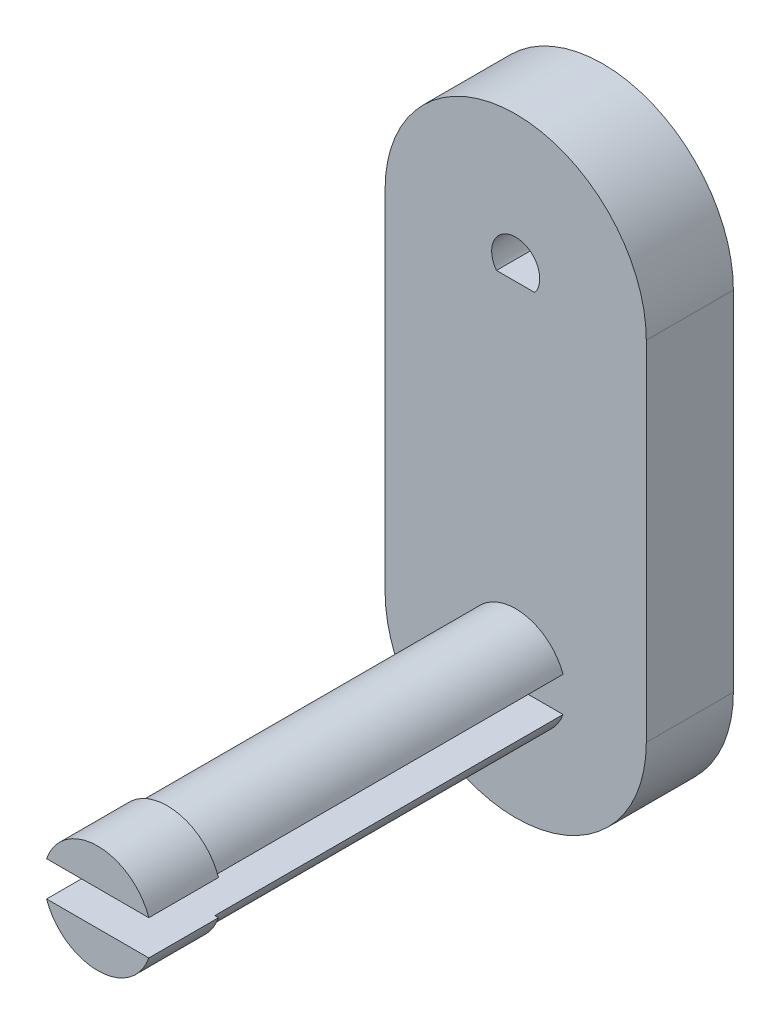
ISO-10303-21;
HEADER;
FILE_DESCRIPTION(('STEP AP214'),'2;1');
FILE_NAME('part.step','',(''),(''),'','','');
FILE_SCHEMA(('AUTOMOTIVE_DESIGN { 1 0 10303 214 1 1 1 1 }'));
ENDSEC;
DATA;
#1=APPLICATION_CONTEXT('core data for automotive mechanical design processes');
#2=APPLICATION_PROTOCOL_DEFINITION('international standard','automotive_design',2000,#1);
#3=PRODUCT_CONTEXT('',#1,'mechanical');
#4=PRODUCT('Part','Part','',(#3));
#5=PRODUCT_RELATED_PRODUCT_CATEGORY('part','',(#4));
#6=PRODUCT_DEFINITION_FORMATION('','',#4);
#7=PRODUCT_DEFINITION_CONTEXT('part definition',#1,'design');
#8=PRODUCT_DEFINITION('design','',#6,#7);
#9=PRODUCT_DEFINITION_SHAPE('','',#8);
#10=(LENGTH_UNIT() NAMED_UNIT(*) SI_UNIT(.MILLI.,.METRE.));
#11=(NAMED_UNIT(*) PLANE_ANGLE_UNIT() SI_UNIT($,.RADIAN.));
#12=(NAMED_UNIT(*) SI_UNIT($,.STERADIAN.) SOLID_ANGLE_UNIT());
#13=UNCERTAINTY_MEASURE_WITH_UNIT(LENGTH_MEASURE(1.E-05),#10,'distance_accuracy_value','');
#14=(GEOMETRIC_REPRESENTATION_CONTEXT(3) GLOBAL_UNCERTAINTY_ASSIGNED_CONTEXT((#13)) GLOBAL_UNIT_ASSIGNED_CONTEXT((#10,
#11,#12)) REPRESENTATION_CONTEXT('',''));
#15=CARTESIAN_POINT('',(0.,0.,0.));
#16=DIRECTION('',(0.,0.,1.));
#17=DIRECTION('',(1.,0.,0.));
#18=AXIS2_PLACEMENT_3D('',#15,#16,#17);
#19=CARTESIAN_POINT('',(0.,0.,-15.));
#20=DIRECTION('',(0.,0.,-1.));
#21=DIRECTION('',(-1.,0.,0.));
#22=AXIS2_PLACEMENT_3D('',#19,#20,#21);
#23=PLANE('',#22);
#24=CARTESIAN_POINT('',(0.,0.,-15.));
#25=DIRECTION('',(0.,0.,-1.));
#26=DIRECTION('',(-1.,0.,0.));
#27=AXIS2_PLACEMENT_3D('',#24,#25,#26);
#28=CIRCLE('',#27,7.5);
#29=CARTESIAN_POINT('',(-7.5,0.,-15.));
#30=VERTEX_POINT('',#29);
#31=CARTESIAN_POINT('',(7.5,0.,-15.));
#32=VERTEX_POINT('',#31);
#33=EDGE_CURVE('E201',#30,#32,#28,.T.);
#34=ORIENTED_EDGE('',*,*,#33,.T.);
#35=DIRECTION('',(0.,-1.,0.));
#36=VECTOR('',#35,1.);
#37=CARTESIAN_POINT('',(7.5,0.,-15.));
#38=LINE('',#37,#36);
#39=CARTESIAN_POINT('',(7.5,-20.,-15.));
#40=VERTEX_POINT('',#39);
#41=EDGE_CURVE('E204',#32,#40,#38,.T.);
#42=ORIENTED_EDGE('',*,*,#41,.T.);
#43=CARTESIAN_POINT('',(0.,-20.,-15.));
#44=DIRECTION('',(0.,0.,-1.));
#45=DIRECTION('',(-1.,0.,0.));
#46=AXIS2_PLACEMENT_3D('',#43,#44,#45);
#47=CIRCLE('',#46,7.5);
#48=CARTESIAN_POINT('',(-7.5,-20.,-15.));
#49=VERTEX_POINT('',#48);
#50=EDGE_CURVE('E207',#40,#49,#47,.T.);
#51=ORIENTED_EDGE('',*,*,#50,.T.);
#52=DIRECTION('',(0.,1.,0.));
#53=VECTOR('',#52,1.);
#54=CARTESIAN_POINT('',(-7.5,0.,-15.));
#55=LINE('',#54,#53);
#56=EDGE_CURVE('E209',#49,#30,#55,.T.);
#57=ORIENTED_EDGE('',*,*,#56,.T.);
#58=EDGE_LOOP('',(#34,#42,#51,#57));
#59=FACE_BOUND('',#58,.T.);
#60=CARTESIAN_POINT('',(0.,0.,-15.));
#61=DIRECTION('',(0.,0.,-1.));
#62=DIRECTION('',(-1.,0.,0.));
#63=AXIS2_PLACEMENT_3D('',#60,#61,#62);
#64=CIRCLE('',#63,1.38);
#65=CARTESIAN_POINT('',(-1.10249716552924,-0.83,-15.));
#66=VERTEX_POINT('',#65);
#67=CARTESIAN_POINT('',(1.10249716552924,-0.83,-15.));
#68=VERTEX_POINT('',#67);
#69=EDGE_CURVE('E140',#66,#68,#64,.T.);
#70=ORIENTED_EDGE('',*,*,#69,.F.);
#71=DIRECTION('',(1.,0.,0.));
#72=VECTOR('',#71,1.);
#73=CARTESIAN_POINT('',(0.,-0.83,-15.));
#74=LINE('',#73,#72);
#75=EDGE_CURVE('E138',#66,#68,#74,.T.);
#76=ORIENTED_EDGE('',*,*,#75,.T.);
#77=EDGE_LOOP('',(#70,#76));
#78=FACE_BOUND('',#77,.T.);
#79=ADVANCED_FACE('F37',(#59,#78),#23,.T.);
#80=CARTESIAN_POINT('',(0.,0.,-10.));
#81=DIRECTION('',(0.,0.,-1.));
#82=DIRECTION('',(-1.,0.,0.));
#83=AXIS2_PLACEMENT_3D('',#80,#81,#82);
#84=PLANE('',#83);
#85=CARTESIAN_POINT('',(0.,0.,-10.));
#86=DIRECTION('',(0.,0.,-1.));
#87=DIRECTION('',(-1.,0.,0.));
#88=AXIS2_PLACEMENT_3D('',#85,#86,#87);
#89=CIRCLE('',#88,7.5);
#90=CARTESIAN_POINT('',(-7.5,0.,-10.));
#91=VERTEX_POINT('',#90);
#92=CARTESIAN_POINT('',(7.5,0.,-10.));
#93=VERTEX_POINT('',#92);
#94=EDGE_CURVE('E200',#91,#93,#89,.T.);
#95=ORIENTED_EDGE('',*,*,#94,.F.);
#96=DIRECTION('',(0.,1.,0.));
#97=VECTOR('',#96,1.);
#98=CARTESIAN_POINT('',(-7.5,0.,-10.));
#99=LINE('',#98,#97);
#100=CARTESIAN_POINT('',(-7.5,-20.,-10.));
#101=VERTEX_POINT('',#100);
#102=EDGE_CURVE('E205',#101,#91,#99,.T.);
#103=ORIENTED_EDGE('',*,*,#102,.F.);
#104=CARTESIAN_POINT('',(0.,-20.,-10.));
#105=DIRECTION('',(0.,0.,-1.));
#106=DIRECTION('',(-1.,0.,0.));
#107=AXIS2_PLACEMENT_3D('',#104,#105,#106);
#108=CIRCLE('',#107,7.5);
#109=CARTESIAN_POINT('',(7.5,-20.,-10.));
#110=VERTEX_POINT('',#109);
#111=EDGE_CURVE('E216',#110,#101,#108,.T.);
#112=ORIENTED_EDGE('',*,*,#111,.F.);
#113=DIRECTION('',(0.,-1.,0.));
#114=VECTOR('',#113,1.);
#115=CARTESIAN_POINT('',(7.5,0.,-10.));
#116=LINE('',#115,#114);
#117=EDGE_CURVE('E214',#93,#110,#116,.T.);
#118=ORIENTED_EDGE('',*,*,#117,.F.);
#119=EDGE_LOOP('',(#95,#103,#112,#118));
#120=FACE_BOUND('',#119,.T.);
#121=DIRECTION('',(1.,0.,0.));
#122=VECTOR('',#121,1.);
#123=CARTESIAN_POINT('',(-5.,-21.,-10.));
#124=LINE('',#123,#122);
#125=CARTESIAN_POINT('',(-2.72213151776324,-21.,-10.));
#126=VERTEX_POINT('',#125);
#127=CARTESIAN_POINT('',(2.72213151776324,-21.,-10.));
#128=VERTEX_POINT('',#127);
#129=EDGE_CURVE('E155',#126,#128,#124,.T.);
#130=ORIENTED_EDGE('',*,*,#129,.T.);
#131=CARTESIAN_POINT('',(0.,-20.,-10.));
#132=DIRECTION('',(0.,0.,-1.));
#133=DIRECTION('',(-1.,0.,0.));
#134=AXIS2_PLACEMENT_3D('',#131,#132,#133);
#135=CIRCLE('',#134,2.9);
#136=EDGE_CURVE('E231',#126,#128,#135,.F.);
#137=ORIENTED_EDGE('',*,*,#136,.F.);
#138=EDGE_LOOP('',(#130,#137));
#139=FACE_BOUND('',#138,.T.);
#140=DIRECTION('',(-1.,0.,0.));
#141=VECTOR('',#140,1.);
#142=CARTESIAN_POINT('',(-5.,-19.,-10.));
#143=LINE('',#142,#141);
#144=CARTESIAN_POINT('',(2.72213151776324,-19.,-10.));
#145=VERTEX_POINT('',#144);
#146=CARTESIAN_POINT('',(-2.72213151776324,-19.,-10.));
#147=VERTEX_POINT('',#146);
#148=EDGE_CURVE('E158',#145,#147,#143,.T.);
#149=ORIENTED_EDGE('',*,*,#148,.T.);
#150=EDGE_CURVE('E230',#145,#147,#135,.F.);
#151=ORIENTED_EDGE('',*,*,#150,.F.);
#152=EDGE_LOOP('',(#149,#151));
#153=FACE_BOUND('',#152,.T.);
#154=DIRECTION('',(-1.,0.,0.));
#155=VECTOR('',#154,1.);
#156=CARTESIAN_POINT('',(0.,-0.83,-10.));
#157=LINE('',#156,#155);
#158=CARTESIAN_POINT('',(1.10249716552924,-0.83,-10.));
#159=VERTEX_POINT('',#158);
#160=CARTESIAN_POINT('',(-1.10249716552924,-0.83,-10.));
#161=VERTEX_POINT('',#160);
#162=EDGE_CURVE('E59',#159,#161,#157,.T.);
#163=ORIENTED_EDGE('',*,*,#162,.T.);
#164=CARTESIAN_POINT('',(0.,0.,-10.));
#165=DIRECTION('',(0.,0.,1.));
#166=DIRECTION('',(1.,0.,0.));
#167=AXIS2_PLACEMENT_3D('',#164,#165,#166);
#168=CIRCLE('',#167,1.38);
#169=EDGE_CURVE('E144',#159,#161,#168,.T.);
#170=ORIENTED_EDGE('',*,*,#169,.F.);
#171=EDGE_LOOP('',(#163,#170));
#172=FACE_BOUND('',#171,.T.);
#173=ADVANCED_FACE('F148',(#120,#139,#153,#172),#84,.F.);
#174=CARTESIAN_POINT('',(0.,-20.,10.));
#175=DIRECTION('',(0.,0.,-1.));
#176=DIRECTION('',(-1.,0.,0.));
#177=AXIS2_PLACEMENT_3D('',#174,#175,#176);
#178=CYLINDRICAL_SURFACE('',#177,2.9);
#179=CARTESIAN_POINT('',(0.,-20.,10.));
#180=DIRECTION('',(0.,0.,1.));
#181=DIRECTION('',(1.,0.,0.));
#182=AXIS2_PLACEMENT_3D('',#179,#180,#181);
#183=CIRCLE('',#182,2.9);
#184=CARTESIAN_POINT('',(2.72213151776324,-19.,10.));
#185=VERTEX_POINT('',#184);
#186=CARTESIAN_POINT('',(-2.72213151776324,-19.,10.));
#187=VERTEX_POINT('',#186);
#188=EDGE_CURVE('E197',#185,#187,#183,.T.);
#189=ORIENTED_EDGE('',*,*,#188,.F.);
#190=DIRECTION('',(0.,0.,-1.));
#191=VECTOR('',#190,1.);
#192=CARTESIAN_POINT('',(2.72213151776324,-19.,10.));
#193=LINE('',#192,#191);
#194=EDGE_CURVE('E185',#185,#145,#193,.T.);
#195=ORIENTED_EDGE('',*,*,#194,.T.);
#196=ORIENTED_EDGE('',*,*,#150,.T.);
#197=DIRECTION('',(0.,0.,-1.));
#198=VECTOR('',#197,1.);
#199=CARTESIAN_POINT('',(-2.72213151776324,-19.,10.));
#200=LINE('',#199,#198);
#201=EDGE_CURVE('E179',#147,#187,#200,.F.);
#202=ORIENTED_EDGE('',*,*,#201,.T.);
#203=EDGE_LOOP('',(#189,#195,#196,#202));
#204=FACE_BOUND('',#203,.T.);
#205=ADVANCED_FACE('F264',(#204),#178,.T.);
#206=CARTESIAN_POINT('',(0.,-20.,14.));
#207=DIRECTION('',(0.,0.,-1.));
#208=DIRECTION('',(-1.,0.,0.));
#209=AXIS2_PLACEMENT_3D('',#206,#207,#208);
#210=CYLINDRICAL_SURFACE('',#209,3.1);
#211=CARTESIAN_POINT('',(0.,-20.,14.));
#212=DIRECTION('',(0.,0.,1.));
#213=DIRECTION('',(1.,0.,0.));
#214=AXIS2_PLACEMENT_3D('',#211,#212,#213);
#215=CIRCLE('',#214,3.1);
#216=CARTESIAN_POINT('',(2.93428015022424,-19.,14.));
#217=VERTEX_POINT('',#216);
#218=CARTESIAN_POINT('',(-2.93428015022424,-19.,14.));
#219=VERTEX_POINT('',#218);
#220=EDGE_CURVE('E189',#217,#219,#215,.T.);
#221=ORIENTED_EDGE('',*,*,#220,.F.);
#222=DIRECTION('',(0.,0.,-1.));
#223=VECTOR('',#222,1.);
#224=CARTESIAN_POINT('',(2.93428015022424,-19.,14.));
#225=LINE('',#224,#223);
#226=CARTESIAN_POINT('',(2.93428015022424,-19.,10.));
#227=VERTEX_POINT('',#226);
#228=EDGE_CURVE('E182',#217,#227,#225,.T.);
#229=ORIENTED_EDGE('',*,*,#228,.T.);
#230=CARTESIAN_POINT('',(0.,-20.,10.));
#231=DIRECTION('',(0.,0.,1.));
#232=DIRECTION('',(1.,0.,0.));
#233=AXIS2_PLACEMENT_3D('',#230,#231,#232);
#234=CIRCLE('',#233,3.1);
#235=CARTESIAN_POINT('',(-2.93428015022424,-19.,10.));
#236=VERTEX_POINT('',#235);
#237=EDGE_CURVE('E194',#227,#236,#234,.T.);
#238=ORIENTED_EDGE('',*,*,#237,.T.);
#239=DIRECTION('',(0.,0.,-1.));
#240=VECTOR('',#239,1.);
#241=CARTESIAN_POINT('',(-2.93428015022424,-19.,14.));
#242=LINE('',#241,#240);
#243=EDGE_CURVE('E176',#236,#219,#242,.F.);
#244=ORIENTED_EDGE('',*,*,#243,.T.);
#245=EDGE_LOOP('',(#221,#229,#238,#244));
#246=FACE_BOUND('',#245,.T.);
#247=ADVANCED_FACE('F250',(#246),#210,.T.);
#248=CARTESIAN_POINT('',(0.,-20.,14.));
#249=DIRECTION('',(0.,0.,1.));
#250=DIRECTION('',(1.,0.,0.));
#251=AXIS2_PLACEMENT_3D('',#248,#249,#250);
#252=PLANE('',#251);
#253=DIRECTION('',(-1.,0.,0.));
#254=VECTOR('',#253,1.);
#255=CARTESIAN_POINT('',(-5.,-19.,14.));
#256=LINE('',#255,#254);
#257=EDGE_CURVE('E159',#217,#219,#256,.T.);
#258=ORIENTED_EDGE('',*,*,#257,.F.);
#259=ORIENTED_EDGE('',*,*,#220,.T.);
#260=EDGE_LOOP('',(#258,#259));
#261=FACE_BOUND('',#260,.T.);
#262=ADVANCED_FACE('F254',(#261),#252,.T.);
#263=CARTESIAN_POINT('',(0.,-20.,10.));
#264=DIRECTION('',(0.,0.,1.));
#265=DIRECTION('',(1.,0.,0.));
#266=AXIS2_PLACEMENT_3D('',#263,#264,#265);
#267=PLANE('',#266);
#268=ORIENTED_EDGE('',*,*,#237,.F.);
#269=DIRECTION('',(-1.,0.,0.));
#270=VECTOR('',#269,1.);
#271=CARTESIAN_POINT('',(0.,-19.,10.));
#272=LINE('',#271,#270);
#273=EDGE_CURVE('E11',#227,#185,#272,.T.);
#274=ORIENTED_EDGE('',*,*,#273,.T.);
#275=ORIENTED_EDGE('',*,*,#188,.T.);
#276=EDGE_CURVE('E41',#187,#236,#272,.T.);
#277=ORIENTED_EDGE('',*,*,#276,.T.);
#278=EDGE_LOOP('',(#268,#274,#275,#277));
#279=FACE_BOUND('',#278,.T.);
#280=ADVANCED_FACE('F245',(#279),#267,.F.);
#281=CARTESIAN_POINT('',(0.,0.,-15.));
#282=DIRECTION('',(0.,0.,1.));
#283=DIRECTION('',(1.,0.,0.));
#284=AXIS2_PLACEMENT_3D('',#281,#282,#283);
#285=CYLINDRICAL_SURFACE('',#284,7.5);
#286=ORIENTED_EDGE('',*,*,#94,.T.);
#287=DIRECTION('',(0.,0.,1.));
#288=VECTOR('',#287,1.);
#289=CARTESIAN_POINT('',(7.5,0.,-15.));
#290=LINE('',#289,#288);
#291=EDGE_CURVE('E227',#32,#93,#290,.T.);
#292=ORIENTED_EDGE('',*,*,#291,.F.);
#293=ORIENTED_EDGE('',*,*,#33,.F.);
#294=DIRECTION('',(0.,0.,1.));
#295=VECTOR('',#294,1.);
#296=CARTESIAN_POINT('',(-7.5,0.,-15.));
#297=LINE('',#296,#295);
#298=EDGE_CURVE('E211',#30,#91,#297,.T.);
#299=ORIENTED_EDGE('',*,*,#298,.T.);
#300=EDGE_LOOP('',(#286,#292,#293,#299));
#301=FACE_BOUND('',#300,.T.);
#302=ADVANCED_FACE('F39',(#301),#285,.T.);
#303=CARTESIAN_POINT('',(7.5,0.,-15.));
#304=DIRECTION('',(-1.,0.,0.));
#305=DIRECTION('',(0.,-1.,0.));
#306=AXIS2_PLACEMENT_3D('',#303,#304,#305);
#307=PLANE('',#306);
#308=ORIENTED_EDGE('',*,*,#117,.T.);
#309=DIRECTION('',(0.,0.,1.));
#310=VECTOR('',#309,1.);
#311=CARTESIAN_POINT('',(7.5,-20.,-15.));
#312=LINE('',#311,#310);
#313=EDGE_CURVE('E224',#40,#110,#312,.T.);
#314=ORIENTED_EDGE('',*,*,#313,.F.);
#315=ORIENTED_EDGE('',*,*,#41,.F.);
#316=ORIENTED_EDGE('',*,*,#291,.T.);
#317=EDGE_LOOP('',(#308,#314,#315,#316));
#318=FACE_BOUND('',#317,.T.);
#319=ADVANCED_FACE('F288',(#318),#307,.F.);
#320=CARTESIAN_POINT('',(0.,-20.,-15.));
#321=DIRECTION('',(0.,0.,1.));
#322=DIRECTION('',(1.,0.,0.));
#323=AXIS2_PLACEMENT_3D('',#320,#321,#322);
#324=CYLINDRICAL_SURFACE('',#323,7.5);
#325=ORIENTED_EDGE('',*,*,#111,.T.);
#326=DIRECTION('',(0.,0.,1.));
#327=VECTOR('',#326,1.);
#328=CARTESIAN_POINT('',(-7.5,-20.,-15.));
#329=LINE('',#328,#327);
#330=EDGE_CURVE('E221',#49,#101,#329,.T.);
#331=ORIENTED_EDGE('',*,*,#330,.F.);
#332=ORIENTED_EDGE('',*,*,#50,.F.);
#333=ORIENTED_EDGE('',*,*,#313,.T.);
#334=EDGE_LOOP('',(#325,#331,#332,#333));
#335=FACE_BOUND('',#334,.T.);
#336=ADVANCED_FACE('F285',(#335),#324,.T.);
#337=CARTESIAN_POINT('',(-7.5,0.,-15.));
#338=DIRECTION('',(1.,0.,0.));
#339=DIRECTION('',(0.,1.,0.));
#340=AXIS2_PLACEMENT_3D('',#337,#338,#339);
#341=PLANE('',#340);
#342=ORIENTED_EDGE('',*,*,#102,.T.);
#343=ORIENTED_EDGE('',*,*,#298,.F.);
#344=ORIENTED_EDGE('',*,*,#56,.F.);
#345=ORIENTED_EDGE('',*,*,#330,.T.);
#346=EDGE_LOOP('',(#342,#343,#344,#345));
#347=FACE_BOUND('',#346,.T.);
#348=ADVANCED_FACE('F282',(#347),#341,.F.);
#349=CARTESIAN_POINT('',(-2.72213151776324,-21.,10.));
#350=VERTEX_POINT('',#349);
#351=CARTESIAN_POINT('',(2.72213151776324,-21.,10.));
#352=VERTEX_POINT('',#351);
#353=EDGE_CURVE('E192',#350,#352,#183,.T.);
#354=ORIENTED_EDGE('',*,*,#353,.F.);
#355=DIRECTION('',(0.,0.,-1.));
#356=VECTOR('',#355,1.);
#357=CARTESIAN_POINT('',(-2.72213151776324,-21.,10.));
#358=LINE('',#357,#356);
#359=EDGE_CURVE('E173',#350,#126,#358,.T.);
#360=ORIENTED_EDGE('',*,*,#359,.T.);
#361=ORIENTED_EDGE('',*,*,#136,.T.);
#362=DIRECTION('',(0.,0.,-1.));
#363=VECTOR('',#362,1.);
#364=CARTESIAN_POINT('',(2.72213151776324,-21.,10.));
#365=LINE('',#364,#363);
#366=EDGE_CURVE('E167',#128,#352,#365,.F.);
#367=ORIENTED_EDGE('',*,*,#366,.T.);
#368=EDGE_LOOP('',(#354,#360,#361,#367));
#369=FACE_BOUND('',#368,.T.);
#370=ADVANCED_FACE('F280',(#369),#178,.T.);
#371=CARTESIAN_POINT('',(-2.93428015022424,-21.,14.));
#372=VERTEX_POINT('',#371);
#373=CARTESIAN_POINT('',(2.93428015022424,-21.,14.));
#374=VERTEX_POINT('',#373);
#375=EDGE_CURVE('E193',#372,#374,#215,.T.);
#376=ORIENTED_EDGE('',*,*,#375,.F.);
#377=DIRECTION('',(0.,0.,-1.));
#378=VECTOR('',#377,1.);
#379=CARTESIAN_POINT('',(-2.93428015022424,-21.,14.));
#380=LINE('',#379,#378);
#381=CARTESIAN_POINT('',(-2.93428015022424,-21.,10.));
#382=VERTEX_POINT('',#381);
#383=EDGE_CURVE('E170',#372,#382,#380,.T.);
#384=ORIENTED_EDGE('',*,*,#383,.T.);
#385=CARTESIAN_POINT('',(2.93428015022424,-21.,10.));
#386=VERTEX_POINT('',#385);
#387=EDGE_CURVE('E188',#382,#386,#234,.T.);
#388=ORIENTED_EDGE('',*,*,#387,.T.);
#389=DIRECTION('',(0.,0.,-1.));
#390=VECTOR('',#389,1.);
#391=CARTESIAN_POINT('',(2.93428015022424,-21.,14.));
#392=LINE('',#391,#390);
#393=EDGE_CURVE('E162',#386,#374,#392,.F.);
#394=ORIENTED_EDGE('',*,*,#393,.T.);
#395=EDGE_LOOP('',(#376,#384,#388,#394));
#396=FACE_BOUND('',#395,.T.);
#397=ADVANCED_FACE('F266',(#396),#210,.T.);
#398=DIRECTION('',(1.,0.,0.));
#399=VECTOR('',#398,1.);
#400=CARTESIAN_POINT('',(-5.,-21.,14.));
#401=LINE('',#400,#399);
#402=EDGE_CURVE('E154',#372,#374,#401,.T.);
#403=ORIENTED_EDGE('',*,*,#402,.F.);
#404=ORIENTED_EDGE('',*,*,#375,.T.);
#405=EDGE_LOOP('',(#403,#404));
#406=FACE_BOUND('',#405,.T.);
#407=ADVANCED_FACE('F257',(#406),#252,.T.);
#408=ORIENTED_EDGE('',*,*,#387,.F.);
#409=DIRECTION('',(1.,0.,0.));
#410=VECTOR('',#409,1.);
#411=CARTESIAN_POINT('',(0.,-21.,10.));
#412=LINE('',#411,#410);
#413=EDGE_CURVE('E235',#382,#350,#412,.T.);
#414=ORIENTED_EDGE('',*,*,#413,.T.);
#415=ORIENTED_EDGE('',*,*,#353,.T.);
#416=EDGE_CURVE('E233',#352,#386,#412,.T.);
#417=ORIENTED_EDGE('',*,*,#416,.T.);
#418=EDGE_LOOP('',(#408,#414,#415,#417));
#419=FACE_BOUND('',#418,.T.);
#420=ADVANCED_FACE('F263',(#419),#267,.F.);
#421=CARTESIAN_POINT('',(-5.,-19.,-10.));
#422=DIRECTION('',(0.,1.,0.));
#423=DIRECTION('',(0.,0.,1.));
#424=AXIS2_PLACEMENT_3D('',#421,#422,#423);
#425=PLANE('',#424);
#426=ORIENTED_EDGE('',*,*,#273,.F.);
#427=ORIENTED_EDGE('',*,*,#228,.F.);
#428=ORIENTED_EDGE('',*,*,#257,.T.);
#429=ORIENTED_EDGE('',*,*,#243,.F.);
#430=ORIENTED_EDGE('',*,*,#276,.F.);
#431=ORIENTED_EDGE('',*,*,#201,.F.);
#432=ORIENTED_EDGE('',*,*,#148,.F.);
#433=ORIENTED_EDGE('',*,*,#194,.F.);
#434=EDGE_LOOP('',(#426,#427,#428,#429,#430,#431,#432,#433));
#435=FACE_BOUND('',#434,.T.);
#436=ADVANCED_FACE('F252',(#435),#425,.F.);
#437=CARTESIAN_POINT('',(-5.,-21.,-10.));
#438=DIRECTION('',(0.,-1.,0.));
#439=DIRECTION('',(0.,0.,-1.));
#440=AXIS2_PLACEMENT_3D('',#437,#438,#439);
#441=PLANE('',#440);
#442=ORIENTED_EDGE('',*,*,#413,.F.);
#443=ORIENTED_EDGE('',*,*,#383,.F.);
#444=ORIENTED_EDGE('',*,*,#402,.T.);
#445=ORIENTED_EDGE('',*,*,#393,.F.);
#446=ORIENTED_EDGE('',*,*,#416,.F.);
#447=ORIENTED_EDGE('',*,*,#366,.F.);
#448=ORIENTED_EDGE('',*,*,#129,.F.);
#449=ORIENTED_EDGE('',*,*,#359,.F.);
#450=EDGE_LOOP('',(#442,#443,#444,#445,#446,#447,#448,#449));
#451=FACE_BOUND('',#450,.T.);
#452=ADVANCED_FACE('F325',(#451),#441,.F.);
#453=CARTESIAN_POINT('',(0.,-0.83,-34.));
#454=DIRECTION('',(0.,1.,0.));
#455=DIRECTION('',(0.,0.,1.));
#456=AXIS2_PLACEMENT_3D('',#453,#454,#455);
#457=PLANE('',#456);
#458=DIRECTION('',(0.,0.,1.));
#459=VECTOR('',#458,1.);
#460=CARTESIAN_POINT('',(-1.10249716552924,-0.83,-34.));
#461=LINE('',#460,#459);
#462=EDGE_CURVE('E52',#66,#161,#461,.T.);
#463=ORIENTED_EDGE('',*,*,#462,.T.);
#464=ORIENTED_EDGE('',*,*,#162,.F.);
#465=DIRECTION('',(0.,0.,1.));
#466=VECTOR('',#465,1.);
#467=CARTESIAN_POINT('',(1.10249716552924,-0.83,-34.));
#468=LINE('',#467,#466);
#469=EDGE_CURVE('E141',#68,#159,#468,.T.);
#470=ORIENTED_EDGE('',*,*,#469,.F.);
#471=ORIENTED_EDGE('',*,*,#75,.F.);
#472=EDGE_LOOP('',(#463,#464,#470,#471));
#473=FACE_BOUND('',#472,.T.);
#474=ADVANCED_FACE('F136',(#473),#457,.T.);
#475=CARTESIAN_POINT('',(0.,0.,-34.));
#476=DIRECTION('',(0.,0.,1.));
#477=DIRECTION('',(1.,0.,0.));
#478=AXIS2_PLACEMENT_3D('',#475,#476,#477);
#479=CYLINDRICAL_SURFACE('',#478,1.38);
#480=ORIENTED_EDGE('',*,*,#69,.T.);
#481=ORIENTED_EDGE('',*,*,#469,.T.);
#482=ORIENTED_EDGE('',*,*,#169,.T.);
#483=ORIENTED_EDGE('',*,*,#462,.F.);
#484=EDGE_LOOP('',(#480,#481,#482,#483));
#485=FACE_BOUND('',#484,.T.);
#486=ADVANCED_FACE('F145',(#485),#479,.F.);
#487=CLOSED_SHELL('',(#79,#173,#205,#247,#262,#280,#302,#319,#336,#348,#370,#397,#407,#420,#436,
#452,#474,#486));
#488=MANIFOLD_SOLID_BREP('B2',#487);
#489=ADVANCED_BREP_SHAPE_REPRESENTATION('',(#18,#488),#14);
#490=SHAPE_DEFINITION_REPRESENTATION(#9,#489);
ENDSEC;
END-ISO-10303-21;
